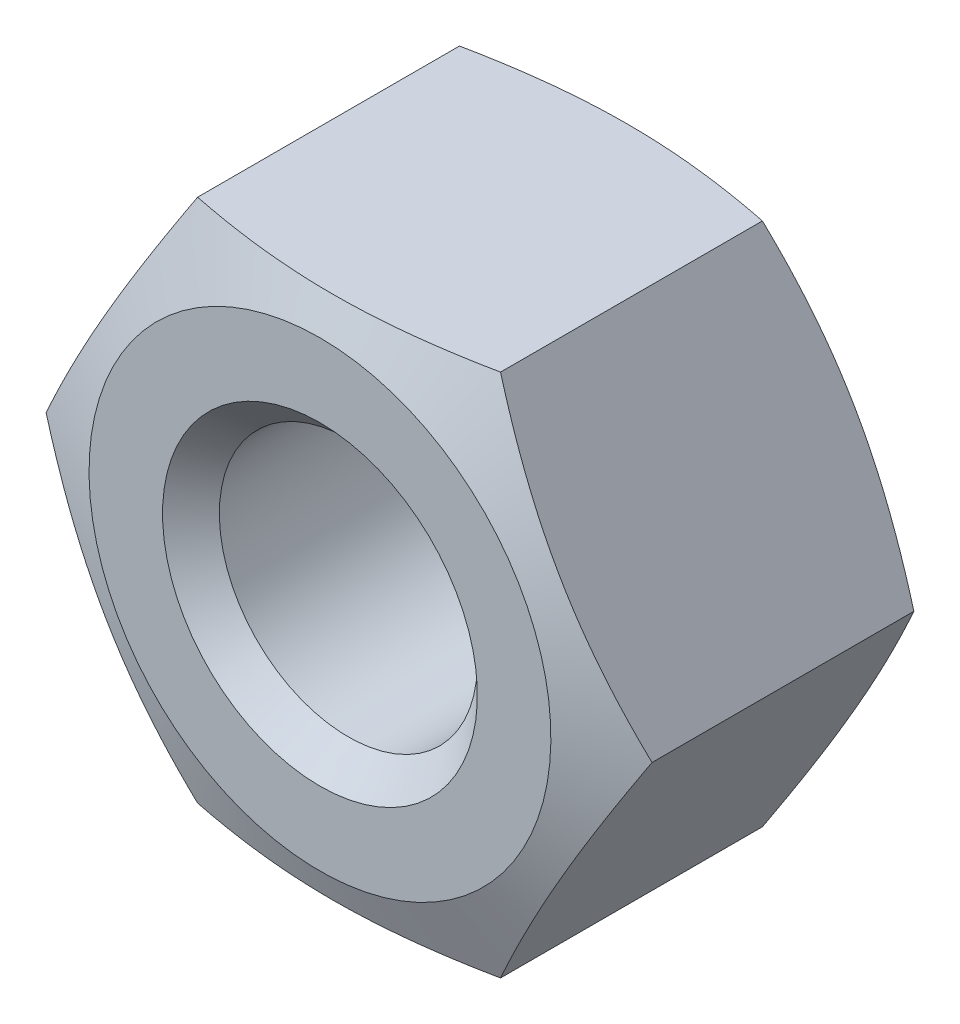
ISO-10303-21;
HEADER;
FILE_DESCRIPTION(('STEP AP214'),'2;1');
FILE_NAME('part.step','',(''),(''),'','','');
FILE_SCHEMA(('AUTOMOTIVE_DESIGN { 1 0 10303 214 1 1 1 1 }'));
ENDSEC;
DATA;
#1=APPLICATION_CONTEXT('core data for automotive mechanical design processes');
#2=APPLICATION_PROTOCOL_DEFINITION('international standard','automotive_design',2000,#1);
#3=PRODUCT_CONTEXT('',#1,'mechanical');
#4=PRODUCT('Part','Part','',(#3));
#5=PRODUCT_RELATED_PRODUCT_CATEGORY('part','',(#4));
#6=PRODUCT_DEFINITION_FORMATION('','',#4);
#7=PRODUCT_DEFINITION_CONTEXT('part definition',#1,'design');
#8=PRODUCT_DEFINITION('design','',#6,#7);
#9=PRODUCT_DEFINITION_SHAPE('','',#8);
#10=(LENGTH_UNIT() NAMED_UNIT(*) SI_UNIT(.MILLI.,.METRE.));
#11=(NAMED_UNIT(*) PLANE_ANGLE_UNIT() SI_UNIT($,.RADIAN.));
#12=(NAMED_UNIT(*) SI_UNIT($,.STERADIAN.) SOLID_ANGLE_UNIT());
#13=UNCERTAINTY_MEASURE_WITH_UNIT(LENGTH_MEASURE(1.E-05),#10,'distance_accuracy_value','');
#14=(GEOMETRIC_REPRESENTATION_CONTEXT(3) GLOBAL_UNCERTAINTY_ASSIGNED_CONTEXT((#13)) GLOBAL_UNIT_ASSIGNED_CONTEXT((#10,
#11,#12)) REPRESENTATION_CONTEXT('',''));
#15=CARTESIAN_POINT('',(0.,0.,0.));
#16=DIRECTION('',(0.,0.,1.));
#17=DIRECTION('',(1.,0.,0.));
#18=AXIS2_PLACEMENT_3D('',#15,#16,#17);
#19=CARTESIAN_POINT('',(5.77349999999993,1.12757025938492E-13,6.09999999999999));
#20=DIRECTION('',(0.,0.,1.));
#21=DIRECTION('',(1.,0.,0.));
#22=AXIS2_PLACEMENT_3D('',#19,#20,#21);
#23=PLANE('',#22);
#24=CARTESIAN_POINT('',(0.,2.2291196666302E-13,6.09999999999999));
#25=DIRECTION('',(0.,0.,-1.));
#26=DIRECTION('',(0.,1.,0.));
#27=AXIS2_PLACEMENT_3D('',#24,#25,#26);
#28=CIRCLE('',#27,3.);
#29=CARTESIAN_POINT('',(0.,3.00000000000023,6.09999999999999));
#30=VERTEX_POINT('',#29);
#31=EDGE_CURVE('E208',#30,#30,#28,.T.);
#32=ORIENTED_EDGE('',*,*,#31,.T.);
#33=EDGE_LOOP('',(#32));
#34=FACE_BOUND('',#33,.T.);
#35=CARTESIAN_POINT('',(0.,2.2291196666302E-13,6.09999999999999));
#36=DIRECTION('',(0.,0.,-1.));
#37=DIRECTION('',(0.,1.,0.));
#38=AXIS2_PLACEMENT_3D('',#35,#36,#37);
#39=CIRCLE('',#38,4.40095183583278);
#40=CARTESIAN_POINT('',(0.,4.40095183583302,6.09999999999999));
#41=VERTEX_POINT('',#40);
#42=EDGE_CURVE('E211',#41,#41,#39,.T.);
#43=ORIENTED_EDGE('',*,*,#42,.F.);
#44=EDGE_LOOP('',(#43));
#45=FACE_BOUND('',#44,.T.);
#46=ADVANCED_FACE('F17',(#34,#45),#23,.T.);
#47=CARTESIAN_POINT('',(0.,2.2291196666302E-13,6.09999999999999));
#48=DIRECTION('',(0.,0.,1.));
#49=DIRECTION('',(0.,-1.,0.));
#50=AXIS2_PLACEMENT_3D('',#47,#48,#49);
#51=CONICAL_SURFACE('',#50,3.,0.785398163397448);
#52=CARTESIAN_POINT('',(0.,0.,5.55875));
#53=DIRECTION('',(0.,0.,-1.));
#54=DIRECTION('',(0.,1.,0.));
#55=AXIS2_PLACEMENT_3D('',#52,#53,#54);
#56=CIRCLE('',#55,2.45875);
#57=CARTESIAN_POINT('',(0.,2.45875000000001,5.55875));
#58=VERTEX_POINT('',#57);
#59=EDGE_CURVE('E98',#58,#58,#56,.T.);
#60=ORIENTED_EDGE('',*,*,#59,.T.);
#61=EDGE_LOOP('',(#60));
#62=FACE_BOUND('',#61,.T.);
#63=ORIENTED_EDGE('',*,*,#31,.F.);
#64=EDGE_LOOP('',(#63));
#65=FACE_BOUND('',#64,.T.);
#66=ADVANCED_FACE('F141',(#62,#65),#51,.F.);
#67=CARTESIAN_POINT('',(0.,0.,0.));
#68=DIRECTION('',(0.,0.,-1.));
#69=DIRECTION('',(0.,1.,0.));
#70=AXIS2_PLACEMENT_3D('',#67,#68,#69);
#71=CYLINDRICAL_SURFACE('',#70,2.45875);
#72=CARTESIAN_POINT('',(0.,0.,0.541250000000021));
#73=DIRECTION('',(0.,0.,-1.));
#74=DIRECTION('',(0.,1.,0.));
#75=AXIS2_PLACEMENT_3D('',#72,#73,#74);
#76=CIRCLE('',#75,2.45875);
#77=CARTESIAN_POINT('',(0.,2.45875000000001,0.541250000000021));
#78=VERTEX_POINT('',#77);
#79=EDGE_CURVE('E95',#78,#78,#76,.T.);
#80=ORIENTED_EDGE('',*,*,#79,.T.);
#81=EDGE_LOOP('',(#80));
#82=FACE_BOUND('',#81,.T.);
#83=ORIENTED_EDGE('',*,*,#59,.F.);
#84=EDGE_LOOP('',(#83));
#85=FACE_BOUND('',#84,.T.);
#86=ADVANCED_FACE('F203',(#82,#85),#71,.F.);
#87=CARTESIAN_POINT('',(0.,0.,0.));
#88=DIRECTION('',(0.,0.,-1.));
#89=DIRECTION('',(0.,1.,0.));
#90=AXIS2_PLACEMENT_3D('',#87,#88,#89);
#91=CONICAL_SURFACE('',#90,3.,0.785398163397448);
#92=ORIENTED_EDGE('',*,*,#79,.F.);
#93=EDGE_LOOP('',(#92));
#94=FACE_BOUND('',#93,.T.);
#95=CARTESIAN_POINT('',(0.,0.,0.));
#96=DIRECTION('',(0.,0.,-1.));
#97=DIRECTION('',(0.,1.,0.));
#98=AXIS2_PLACEMENT_3D('',#95,#96,#97);
#99=CIRCLE('',#98,3.);
#100=CARTESIAN_POINT('',(0.,3.00000000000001,0.));
#101=VERTEX_POINT('',#100);
#102=EDGE_CURVE('E212',#101,#101,#99,.T.);
#103=ORIENTED_EDGE('',*,*,#102,.T.);
#104=EDGE_LOOP('',(#103));
#105=FACE_BOUND('',#104,.T.);
#106=ADVANCED_FACE('F139',(#94,#105),#91,.F.);
#107=CARTESIAN_POINT('',(0.,0.,5.54545454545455));
#108=DIRECTION('',(0.,0.,-1.));
#109=DIRECTION('',(0.,1.,0.));
#110=AXIS2_PLACEMENT_3D('',#107,#108,#109);
#111=CONICAL_SURFACE('',#110,5.7735,1.18682389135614);
#112=ORIENTED_EDGE('',*,*,#42,.T.);
#113=EDGE_LOOP('',(#112));
#114=FACE_BOUND('',#113,.T.);
#115=CARTESIAN_POINT('',(-7.62200767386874,-4.9999976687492,4.19514045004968));
#116=CARTESIAN_POINT('',(-7.39656834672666,-4.99999766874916,4.27127768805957));
#117=CARTESIAN_POINT('',(-7.17082855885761,-4.99999766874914,4.34654172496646));
#118=CARTESIAN_POINT('',(-6.7185926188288,-4.99999766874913,4.49483547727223));
#119=CARTESIAN_POINT('',(-6.4920963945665,-4.99999766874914,4.56786497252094));
#120=CARTESIAN_POINT('',(-6.03768565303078,-4.99999766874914,4.7113604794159));
#121=CARTESIAN_POINT('',(-5.80976902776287,-4.99999766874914,4.78181983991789));
#122=CARTESIAN_POINT('',(-5.35290488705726,-4.99999766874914,4.9193060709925));
#123=CARTESIAN_POINT('',(-5.12395739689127,-4.99999766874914,4.98633302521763));
#124=CARTESIAN_POINT('',(-4.66781400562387,-4.99999766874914,5.11525045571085));
#125=CARTESIAN_POINT('',(-4.44063380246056,-4.99999766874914,5.17719619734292));
#126=CARTESIAN_POINT('',(-3.98489022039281,-4.99999766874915,5.29583960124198));
#127=CARTESIAN_POINT('',(-3.75632680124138,-4.99999766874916,5.35253711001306));
#128=CARTESIAN_POINT('',(-3.29778581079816,-4.99999766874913,5.45932575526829));
#129=CARTESIAN_POINT('',(-3.06780911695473,-4.99999766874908,5.50942062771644));
#130=CARTESIAN_POINT('',(-2.60622171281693,-4.99999766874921,5.60145215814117));
#131=CARTESIAN_POINT('',(-2.3746111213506,-4.99999766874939,5.64338940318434));
#132=CARTESIAN_POINT('',(-1.95734014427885,-4.99999766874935,5.70978116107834));
#133=CARTESIAN_POINT('',(-1.77197103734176,-4.9999976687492,5.73605708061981));
#134=CARTESIAN_POINT('',(-1.4003631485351,-4.99999766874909,5.78145498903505));
#135=CARTESIAN_POINT('',(-1.21412444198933,-4.99999766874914,5.80057758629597));
#136=CARTESIAN_POINT('',(-0.84111100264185,-4.99999766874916,5.83091427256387));
#137=CARTESIAN_POINT('',(-0.654336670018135,-4.99999766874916,5.84213321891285));
#138=CARTESIAN_POINT('',(-0.280469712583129,-4.99999766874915,5.85619153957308));
#139=CARTESIAN_POINT('',(-0.0933770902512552,-4.99999766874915,5.85903097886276));
#140=CARTESIAN_POINT('',(0.281651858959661,-4.99999766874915,5.85619256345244));
#141=CARTESIAN_POINT('',(0.469587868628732,-4.99999766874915,5.85047326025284));
#142=CARTESIAN_POINT('',(0.845017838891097,-4.99999766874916,5.83070414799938));
#143=CARTESIAN_POINT('',(1.03251179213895,-4.99999766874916,5.81665420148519));
#144=CARTESIAN_POINT('',(1.40686944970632,-4.99999766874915,5.78081274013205));
#145=CARTESIAN_POINT('',(1.59373267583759,-4.99999766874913,5.75901629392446));
#146=CARTESIAN_POINT('',(1.96650919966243,-4.99999766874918,5.70850225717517));
#147=CARTESIAN_POINT('',(2.15242250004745,-4.99999766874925,5.67978468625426));
#148=CARTESIAN_POINT('',(2.55438660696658,-4.99999766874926,5.61099947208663));
#149=CARTESIAN_POINT('',(2.77024854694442,-4.99999766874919,5.56983529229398));
#150=CARTESIAN_POINT('',(3.2005675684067,-4.99999766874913,5.48070685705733));
#151=CARTESIAN_POINT('',(3.41502452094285,-4.99999766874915,5.43274198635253));
#152=CARTESIAN_POINT('',(3.84272273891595,-4.99999766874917,5.33124341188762));
#153=CARTESIAN_POINT('',(4.05596332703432,-4.99999766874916,5.27770687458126));
#154=CARTESIAN_POINT('',(4.48125020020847,-4.99999766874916,5.16614085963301));
#155=CARTESIAN_POINT('',(4.6932965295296,-4.99999766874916,5.10811154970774));
#156=CARTESIAN_POINT('',(5.11690900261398,-4.99999766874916,4.98825862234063));
#157=CARTESIAN_POINT('',(5.32847243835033,-4.99999766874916,4.92642547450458));
#158=CARTESIAN_POINT('',(5.75070771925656,-4.99999766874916,4.79978434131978));
#159=CARTESIAN_POINT('',(5.96137954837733,-4.99999766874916,4.73497630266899));
#160=CARTESIAN_POINT('',(6.5921376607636,-4.99999766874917,4.53697630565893));
#161=CARTESIAN_POINT('',(7.01108925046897,-4.99999766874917,4.40017302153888));
#162=CARTESIAN_POINT('',(7.84393068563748,-4.99999766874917,4.12100666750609));
#163=CARTESIAN_POINT('',(8.25783555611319,-4.99999766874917,3.97868798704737));
#164=CARTESIAN_POINT('',(9.08408239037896,-4.99999766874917,3.68949595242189));
#165=CARTESIAN_POINT('',(9.49642423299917,-4.99999766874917,3.54262225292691));
#166=CARTESIAN_POINT('',(10.3171976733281,-4.99999766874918,3.24656607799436));
#167=CARTESIAN_POINT('',(10.7256371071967,-4.99999766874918,3.09740526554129));
#168=CARTESIAN_POINT('',(11.3375987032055,-4.99999766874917,2.87185494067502));
#169=CARTESIAN_POINT('',(11.5414568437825,-4.99999766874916,2.79637478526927));
#170=CARTESIAN_POINT('',(11.9489744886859,-4.99999766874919,2.64488231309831));
#171=CARTESIAN_POINT('',(12.1526339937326,-4.99999766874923,2.56886999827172));
#172=CARTESIAN_POINT('',(12.3562075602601,-4.99999766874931,2.49262826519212));
#173=B_SPLINE_CURVE_WITH_KNOTS('',3,(#115,#116,#117,#118,#119,#120,#121,#122,#123,#124,#125,
#126,#127,#128,#129,#130,#131,#132,#133,#134,#135,#136,#137,#138,#139,#140,#141,#142,#143,#144,
#145,#146,#147,#148,#149,#150,#151,#152,#153,#154,#155,#156,#157,#158,#159,#160,#161,#162,#163,
#164,#165,#166,#167,#168,#169,#170,#171,#172),.UNSPECIFIED.,.F.,.F.,(4,2,2,2,2,2,2,2,2,2,2,2,2,
2,2,2,2,2,2,2,2,2,2,2,2,2,2,2,4),(0.,0.713853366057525,1.42777683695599,2.14343285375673,
2.85907142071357,3.56544487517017,4.27183898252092,4.97783165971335,5.68377351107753,
6.24532011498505,6.80681894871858,7.3679724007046,7.92912150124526,8.49299695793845,
9.05688171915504,9.62112609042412,10.1853688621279,10.8444872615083,11.5036653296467,
12.1631802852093,12.82267063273,13.4838865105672,14.1451142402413,15.4671867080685,
16.7802233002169,18.0933596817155,19.3978209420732,20.0499695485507,20.702115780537),.UNSPECIFIED.);
#174=CARTESIAN_POINT('',(-2.88675000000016,-4.99999766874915,5.54545454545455));
#175=VERTEX_POINT('',#174);
#176=CARTESIAN_POINT('',(2.88674999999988,-4.99999766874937,5.54545454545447));
#177=VERTEX_POINT('',#176);
#178=EDGE_CURVE('E78',#175,#177,#173,.T.);
#179=ORIENTED_EDGE('',*,*,#178,.T.);
#180=CARTESIAN_POINT('',(2.8867498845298,-4.99999786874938,5.54545449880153));
#181=CARTESIAN_POINT('',(2.98760513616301,-4.82531144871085,5.58620500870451));
#182=CARTESIAN_POINT('',(3.08879327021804,-4.65004845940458,5.62388541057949));
#183=CARTESIAN_POINT('',(3.29183863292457,-4.29836357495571,5.69194788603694));
#184=CARTESIAN_POINT('',(3.39369621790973,-4.12194106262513,5.72232568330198));
#185=CARTESIAN_POINT('',(3.59793549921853,-3.76818825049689,5.77456670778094));
#186=CARTESIAN_POINT('',(3.70031703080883,-3.59085823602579,5.79643246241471));
#187=CARTESIAN_POINT('',(3.90546039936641,-3.23553949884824,5.83063610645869));
#188=CARTESIAN_POINT('',(4.00822214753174,-3.05755092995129,5.84297609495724));
#189=CARTESIAN_POINT('',(4.21218124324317,-2.70428341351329,5.85736083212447));
#190=CARTESIAN_POINT('',(4.31337552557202,-2.52900977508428,5.85957683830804));
#191=CARTESIAN_POINT('',(4.51570428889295,-2.1785660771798,5.85406013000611));
#192=CARTESIAN_POINT('',(4.61683876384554,-2.00339602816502,5.84632654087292));
#193=CARTESIAN_POINT('',(4.81874245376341,-1.65368857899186,5.82132638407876));
#194=CARTESIAN_POINT('',(4.9195118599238,-1.47915084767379,5.8040658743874));
#195=CARTESIAN_POINT('',(5.12056954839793,-1.13090871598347,5.76084835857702));
#196=CARTESIAN_POINT('',(5.22085787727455,-0.957204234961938,5.73489221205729));
#197=CARTESIAN_POINT('',(5.35868198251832,-0.718485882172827,5.69386305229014));
#198=CARTESIAN_POINT('',(5.39646887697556,-0.653037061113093,5.68205619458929));
#199=CARTESIAN_POINT('',(5.47195348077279,-0.522293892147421,5.65741433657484));
#200=CARTESIAN_POINT('',(5.50965120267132,-0.456999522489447,5.64457949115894));
#201=CARTESIAN_POINT('',(5.58508963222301,-0.326336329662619,5.61789534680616));
#202=CARTESIAN_POINT('',(5.6228300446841,-0.260968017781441,5.60404272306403));
#203=CARTESIAN_POINT('',(5.69822818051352,-0.130374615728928,5.57542079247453));
#204=CARTESIAN_POINT('',(5.73588589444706,-0.0651495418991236,5.56065138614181));
#205=CARTESIAN_POINT('',(5.77350011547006,2.00000018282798E-07,5.54545449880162));
#206=B_SPLINE_CURVE_WITH_KNOTS('',3,(#180,#181,#182,#183,#184,#185,#186,#187,#188,#189,#190,
#191,#192,#193,#194,#195,#196,#197,#198,#199,#200,#201,#202,#203,#204,#205),.UNSPECIFIED.,.F.,
.F.,(4,2,2,2,2,2,2,2,2,2,2,2,4),(0.,0.61740014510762,1.235160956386,1.85273820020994,
2.47017931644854,3.07713614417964,3.68414633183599,4.29077097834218,4.89733567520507,
5.12680289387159,5.35623560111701,5.58645432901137,5.81669808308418),.UNSPECIFIED.);
#207=CARTESIAN_POINT('',(5.77349999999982,1.12757025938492E-13,5.54545454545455));
#208=VERTEX_POINT('',#207);
#209=EDGE_CURVE('E163',#177,#208,#206,.T.);
#210=ORIENTED_EDGE('',*,*,#209,.T.);
#211=CARTESIAN_POINT('',(5.77350011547,-1.99999848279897E-07,5.54545449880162));
#212=CARTESIAN_POINT('',(5.67264486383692,0.174686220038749,5.58620500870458));
#213=CARTESIAN_POINT('',(5.57145672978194,0.349949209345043,5.62388541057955));
#214=CARTESIAN_POINT('',(5.36841136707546,0.701634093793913,5.69194788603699));
#215=CARTESIAN_POINT('',(5.26655378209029,0.878056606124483,5.72232568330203));
#216=CARTESIAN_POINT('',(5.06231450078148,1.2318094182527,5.77456670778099));
#217=CARTESIAN_POINT('',(4.95993296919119,1.4091394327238,5.79643246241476));
#218=CARTESIAN_POINT('',(4.75478960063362,1.76445816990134,5.83063610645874));
#219=CARTESIAN_POINT('',(4.65202785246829,1.94244673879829,5.84297609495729));
#220=CARTESIAN_POINT('',(4.44806875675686,2.29571425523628,5.85736083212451));
#221=CARTESIAN_POINT('',(4.34687447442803,2.47098789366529,5.85957683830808));
#222=CARTESIAN_POINT('',(4.14454571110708,2.82143159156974,5.85406013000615));
#223=CARTESIAN_POINT('',(4.04341123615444,2.99660164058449,5.84632654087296));
#224=CARTESIAN_POINT('',(3.84150754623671,3.3463090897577,5.82132638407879));
#225=CARTESIAN_POINT('',(3.74073814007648,3.52084682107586,5.80406587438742));
#226=CARTESIAN_POINT('',(3.53968045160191,3.8690889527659,5.76084835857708));
#227=CARTESIAN_POINT('',(3.43939212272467,4.04279343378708,5.7348922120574));
#228=CARTESIAN_POINT('',(3.30156801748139,4.28151178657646,5.69386305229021));
#229=CARTESIAN_POINT('',(3.26378112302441,4.34696060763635,5.68205619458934));
#230=CARTESIAN_POINT('',(3.18829651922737,4.47770377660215,5.65741433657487));
#231=CARTESIAN_POINT('',(3.15059879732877,4.54299814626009,5.64457949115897));
#232=CARTESIAN_POINT('',(3.07516036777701,4.6736613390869,5.61789534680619));
#233=CARTESIAN_POINT('',(3.03741995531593,4.73902965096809,5.60404272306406));
#234=CARTESIAN_POINT('',(2.96202181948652,4.86962305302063,5.57542079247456));
#235=CARTESIAN_POINT('',(2.92436410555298,4.93484812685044,5.56065138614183));
#236=CARTESIAN_POINT('',(2.8867498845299,4.99999786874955,5.54545449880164));
#237=B_SPLINE_CURVE_WITH_KNOTS('',3,(#211,#212,#213,#214,#215,#216,#217,#218,#219,#220,#221,
#222,#223,#224,#225,#226,#227,#228,#229,#230,#231,#232,#233,#234,#235,#236),.UNSPECIFIED.,.F.,
.F.,(4,2,2,2,2,2,2,2,2,2,2,2,4),(0.,0.617400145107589,1.23516095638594,1.85273820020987,
2.47017931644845,3.07713614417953,3.68414633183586,4.29077097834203,4.89733567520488,
5.12680289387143,5.35623560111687,5.58645432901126,5.81669808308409),.UNSPECIFIED.);
#238=CARTESIAN_POINT('',(2.88674999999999,4.99999766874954,5.54545454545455));
#239=VERTEX_POINT('',#238);
#240=EDGE_CURVE('E40',#208,#239,#237,.T.);
#241=ORIENTED_EDGE('',*,*,#240,.T.);
#242=CARTESIAN_POINT('',(-7.62200767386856,4.9999976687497,4.19514045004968));
#243=CARTESIAN_POINT('',(-7.39656834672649,4.99999766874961,4.27127768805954));
#244=CARTESIAN_POINT('',(-7.17082855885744,4.99999766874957,4.34654172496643));
#245=CARTESIAN_POINT('',(-6.71859261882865,4.99999766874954,4.49483547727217));
#246=CARTESIAN_POINT('',(-6.49209639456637,4.99999766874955,4.56786497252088));
#247=CARTESIAN_POINT('',(-6.03768565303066,4.99999766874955,4.71136047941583));
#248=CARTESIAN_POINT('',(-5.80976902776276,4.99999766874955,4.78181983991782));
#249=CARTESIAN_POINT('',(-5.35290488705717,4.99999766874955,4.91930607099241));
#250=CARTESIAN_POINT('',(-5.12395739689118,4.99999766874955,4.98633302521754));
#251=CARTESIAN_POINT('',(-4.66781400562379,4.99999766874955,5.11525045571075));
#252=CARTESIAN_POINT('',(-4.44063380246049,4.99999766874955,5.17719619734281));
#253=CARTESIAN_POINT('',(-3.98489022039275,4.99999766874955,5.29583960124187));
#254=CARTESIAN_POINT('',(-3.75632680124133,4.99999766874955,5.35253711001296));
#255=CARTESIAN_POINT('',(-3.29778581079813,4.99999766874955,5.45932575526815));
#256=CARTESIAN_POINT('',(-3.06780911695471,4.99999766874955,5.50942062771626));
#257=CARTESIAN_POINT('',(-2.60622171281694,4.99999766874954,5.60145215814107));
#258=CARTESIAN_POINT('',(-2.37461112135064,4.99999766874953,5.64338940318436));
#259=CARTESIAN_POINT('',(-1.95734014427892,4.99999766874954,5.70978116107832));
#260=CARTESIAN_POINT('',(-1.77197103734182,4.99999766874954,5.73605708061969));
#261=CARTESIAN_POINT('',(-1.40036314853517,4.99999766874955,5.78145498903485));
#262=CARTESIAN_POINT('',(-1.21412444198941,4.99999766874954,5.8005775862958));
#263=CARTESIAN_POINT('',(-0.841111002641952,4.99999766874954,5.83091427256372));
#264=CARTESIAN_POINT('',(-0.654336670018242,4.99999766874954,5.84213321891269));
#265=CARTESIAN_POINT('',(-0.280469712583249,4.99999766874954,5.85619153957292));
#266=CARTESIAN_POINT('',(-0.0933770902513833,4.99999766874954,5.8590309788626));
#267=CARTESIAN_POINT('',(0.281651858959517,4.99999766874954,5.85619256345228));
#268=CARTESIAN_POINT('',(0.46958786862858,4.99999766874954,5.85047326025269));
#269=CARTESIAN_POINT('',(0.845017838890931,4.99999766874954,5.83070414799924));
#270=CARTESIAN_POINT('',(1.03251179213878,4.99999766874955,5.81665420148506));
#271=CARTESIAN_POINT('',(1.40686944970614,4.99999766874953,5.78081274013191));
#272=CARTESIAN_POINT('',(1.59373267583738,4.9999976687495,5.75901629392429));
#273=CARTESIAN_POINT('',(1.96650919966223,4.99999766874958,5.70850225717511));
#274=CARTESIAN_POINT('',(2.15242250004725,4.99999766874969,5.67978468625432));
#275=CARTESIAN_POINT('',(2.55438660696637,4.99999766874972,5.61099947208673));
#276=CARTESIAN_POINT('',(2.77024854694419,4.99999766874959,5.56983529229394));
#277=CARTESIAN_POINT('',(3.20056756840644,4.99999766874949,5.4807068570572));
#278=CARTESIAN_POINT('',(3.4150245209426,4.99999766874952,5.43274198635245));
#279=CARTESIAN_POINT('',(3.84272273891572,4.99999766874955,5.33124341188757));
#280=CARTESIAN_POINT('',(4.05596332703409,4.99999766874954,5.27770687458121));
#281=CARTESIAN_POINT('',(4.48125020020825,4.99999766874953,5.16614085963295));
#282=CARTESIAN_POINT('',(4.69329652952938,4.99999766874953,5.10811154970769));
#283=CARTESIAN_POINT('',(5.11690900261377,4.99999766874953,4.98825862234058));
#284=CARTESIAN_POINT('',(5.32847243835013,4.99999766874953,4.92642547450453));
#285=CARTESIAN_POINT('',(5.75070771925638,4.99999766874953,4.79978434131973));
#286=CARTESIAN_POINT('',(5.96137954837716,4.99999766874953,4.73497630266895));
#287=CARTESIAN_POINT('',(6.59213766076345,4.99999766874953,4.5369763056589));
#288=CARTESIAN_POINT('',(7.01108925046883,4.99999766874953,4.40017302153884));
#289=CARTESIAN_POINT('',(7.84393068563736,4.99999766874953,4.12100666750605));
#290=CARTESIAN_POINT('',(8.25783555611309,4.99999766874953,3.97868798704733));
#291=CARTESIAN_POINT('',(9.08408239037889,4.99999766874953,3.68949595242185));
#292=CARTESIAN_POINT('',(9.49642423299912,4.99999766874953,3.54262225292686));
#293=CARTESIAN_POINT('',(10.3171976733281,4.99999766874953,3.24656607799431));
#294=CARTESIAN_POINT('',(10.7256371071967,4.99999766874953,3.09740526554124));
#295=CARTESIAN_POINT('',(11.3375987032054,4.99999766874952,2.87185494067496));
#296=CARTESIAN_POINT('',(11.5414568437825,4.99999766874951,2.79637478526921));
#297=CARTESIAN_POINT('',(11.9489744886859,4.99999766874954,2.64488231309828));
#298=CARTESIAN_POINT('',(12.1526339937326,4.99999766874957,2.5688699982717));
#299=CARTESIAN_POINT('',(12.3562075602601,4.99999766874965,2.49262826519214));
#300=B_SPLINE_CURVE_WITH_KNOTS('',3,(#242,#243,#244,#245,#246,#247,#248,#249,#250,#251,#252,
#253,#254,#255,#256,#257,#258,#259,#260,#261,#262,#263,#264,#265,#266,#267,#268,#269,#270,#271,
#272,#273,#274,#275,#276,#277,#278,#279,#280,#281,#282,#283,#284,#285,#286,#287,#288,#289,#290,
#291,#292,#293,#294,#295,#296,#297,#298,#299),.UNSPECIFIED.,.F.,.F.,(4,2,2,2,2,2,2,2,2,2,2,2,2,
2,2,2,2,2,2,2,2,2,2,2,2,2,2,2,4),(0.,0.713853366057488,1.42777683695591,2.14343285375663,
2.85907142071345,3.56544487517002,4.27183898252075,4.97783165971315,5.68377351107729,
6.24532011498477,6.80681894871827,7.36797240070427,7.92912150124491,8.49299695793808,
9.05688171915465,9.6211260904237,10.1853688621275,10.8444872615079,11.5036653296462,
12.1631802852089,12.8226706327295,13.4838865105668,14.1451142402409,15.4671867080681,
16.7802233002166,18.0933596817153,19.397820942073,20.0499695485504,20.7021157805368),.UNSPECIFIED.);
#301=CARTESIAN_POINT('',(-2.88675000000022,4.99999766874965,5.54545454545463));
#302=VERTEX_POINT('',#301);
#303=EDGE_CURVE('E154',#239,#302,#300,.F.);
#304=ORIENTED_EDGE('',*,*,#303,.T.);
#305=CARTESIAN_POINT('',(-2.88674988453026,4.99999786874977,5.5454544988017));
#306=CARTESIAN_POINT('',(-2.98760513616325,4.8253114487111,5.58620500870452));
#307=CARTESIAN_POINT('',(-3.08879327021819,4.65004845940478,5.62388541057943));
#308=CARTESIAN_POINT('',(-3.29183863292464,4.29836357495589,5.69194788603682));
#309=CARTESIAN_POINT('',(-3.39369621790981,4.12194106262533,5.72232568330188));
#310=CARTESIAN_POINT('',(-3.59793549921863,3.76818825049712,5.77456670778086));
#311=CARTESIAN_POINT('',(-3.70031703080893,3.590858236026,5.79643246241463));
#312=CARTESIAN_POINT('',(-3.90546039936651,3.23553949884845,5.8306361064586));
#313=CARTESIAN_POINT('',(-4.00822214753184,3.05755092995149,5.84297609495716));
#314=CARTESIAN_POINT('',(-4.21218124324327,2.7042834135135,5.85736083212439));
#315=CARTESIAN_POINT('',(-4.31337552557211,2.52900977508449,5.85957683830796));
#316=CARTESIAN_POINT('',(-4.51570428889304,2.17856607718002,5.85406013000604));
#317=CARTESIAN_POINT('',(-4.61683876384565,2.00339602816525,5.84632654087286));
#318=CARTESIAN_POINT('',(-4.81874245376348,1.65368857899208,5.82132638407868));
#319=CARTESIAN_POINT('',(-4.91951185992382,1.479150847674,5.80406587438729));
#320=CARTESIAN_POINT('',(-5.12056954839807,1.13090871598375,5.76084835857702));
#321=CARTESIAN_POINT('',(-5.22085787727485,0.957204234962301,5.73489221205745));
#322=CARTESIAN_POINT('',(-5.35868198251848,0.718485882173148,5.69386305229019));
#323=CARTESIAN_POINT('',(-5.39646887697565,0.653037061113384,5.68205619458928));
#324=CARTESIAN_POINT('',(-5.47195348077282,0.522293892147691,5.65741433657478));
#325=CARTESIAN_POINT('',(-5.50965120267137,0.456999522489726,5.6445794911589));
#326=CARTESIAN_POINT('',(-5.58508963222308,0.326336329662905,5.61789534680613));
#327=CARTESIAN_POINT('',(-5.62283004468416,0.260968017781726,5.60404272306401));
#328=CARTESIAN_POINT('',(-5.69822818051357,0.130374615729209,5.57542079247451));
#329=CARTESIAN_POINT('',(-5.7358858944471,0.0651495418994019,5.56065138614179));
#330=CARTESIAN_POINT('',(-5.77350011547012,-1.99999738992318E-07,5.54545449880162));
#331=B_SPLINE_CURVE_WITH_KNOTS('',3,(#305,#306,#307,#308,#309,#310,#311,#312,#313,#314,#315,
#316,#317,#318,#319,#320,#321,#322,#323,#324,#325,#326,#327,#328,#329,#330),.UNSPECIFIED.,.F.,
.F.,(4,2,2,2,2,2,2,2,2,2,2,2,4),(0.,0.617400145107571,1.23516095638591,1.85273820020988,
2.47017931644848,3.07713614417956,3.6841463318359,4.29077097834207,4.89733567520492,
5.12680289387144,5.35623560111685,5.58645432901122,5.81669808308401),.UNSPECIFIED.);
#332=CARTESIAN_POINT('',(-5.77350000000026,1.10154940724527E-13,5.54545454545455));
#333=VERTEX_POINT('',#332);
#334=EDGE_CURVE('E149',#302,#333,#331,.T.);
#335=ORIENTED_EDGE('',*,*,#334,.T.);
#336=CARTESIAN_POINT('',(-5.77350011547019,2.00000071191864E-07,5.54545449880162));
#337=CARTESIAN_POINT('',(-5.67264486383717,-0.174686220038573,5.58620500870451));
#338=CARTESIAN_POINT('',(-5.57145672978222,-0.349949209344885,5.62388541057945));
#339=CARTESIAN_POINT('',(-5.36841136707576,-0.701634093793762,5.69194788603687));
#340=CARTESIAN_POINT('',(-5.2665537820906,-0.878056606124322,5.72232568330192));
#341=CARTESIAN_POINT('',(-5.06231450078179,-1.23180941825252,5.77456670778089));
#342=CARTESIAN_POINT('',(-4.9599329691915,-1.40913943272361,5.79643246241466));
#343=CARTESIAN_POINT('',(-4.75478960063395,-1.76445816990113,5.83063610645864));
#344=CARTESIAN_POINT('',(-4.65202785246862,-1.94244673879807,5.8429760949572));
#345=CARTESIAN_POINT('',(-4.44806875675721,-2.29571425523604,5.85736083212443));
#346=CARTESIAN_POINT('',(-4.34687447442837,-2.47098789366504,5.85957683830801));
#347=CARTESIAN_POINT('',(-4.14454571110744,-2.82143159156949,5.85406013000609));
#348=CARTESIAN_POINT('',(-4.04341123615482,-2.99660164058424,5.8463265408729));
#349=CARTESIAN_POINT('',(-3.84150754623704,-3.34630908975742,5.82132638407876));
#350=CARTESIAN_POINT('',(-3.74073814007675,-3.52084682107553,5.80406587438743));
#351=CARTESIAN_POINT('',(-3.53968045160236,-3.86908895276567,5.76084835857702));
#352=CARTESIAN_POINT('',(-3.43939212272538,-4.04279343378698,5.73489221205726));
#353=CARTESIAN_POINT('',(-3.3015680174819,-4.28151178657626,5.69386305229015));
#354=CARTESIAN_POINT('',(-3.26378112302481,-4.3469606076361,5.68205619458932));
#355=CARTESIAN_POINT('',(-3.18829651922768,-4.47770377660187,5.65741433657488));
#356=CARTESIAN_POINT('',(-3.15059879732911,-4.54299814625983,5.64457949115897));
#357=CARTESIAN_POINT('',(-3.07516036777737,-4.67366133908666,5.61789534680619));
#358=CARTESIAN_POINT('',(-3.03741995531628,-4.73902965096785,5.60404272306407));
#359=CARTESIAN_POINT('',(-2.96202181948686,-4.86962305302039,5.57542079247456));
#360=CARTESIAN_POINT('',(-2.92436410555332,-4.93484812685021,5.56065138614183));
#361=CARTESIAN_POINT('',(-2.88674988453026,-4.99999786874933,5.54545449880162));
#362=B_SPLINE_CURVE_WITH_KNOTS('',3,(#336,#337,#338,#339,#340,#341,#342,#343,#344,#345,#346,
#347,#348,#349,#350,#351,#352,#353,#354,#355,#356,#357,#358,#359,#360,#361),.UNSPECIFIED.,.F.,
.F.,(4,2,2,2,2,2,2,2,2,2,2,2,4),(0.,0.617400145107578,1.23516095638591,1.85273820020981,
2.47017931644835,3.07713614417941,3.68414633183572,4.29077097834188,4.89733567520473,
5.12680289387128,5.35623560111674,5.58645432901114,5.81669808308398),.UNSPECIFIED.);
#363=EDGE_CURVE('E126',#333,#175,#362,.T.);
#364=ORIENTED_EDGE('',*,*,#363,.T.);
#365=EDGE_LOOP('',(#179,#210,#241,#304,#335,#364));
#366=FACE_BOUND('',#365,.T.);
#367=ADVANCED_FACE('F135',(#114,#366),#111,.T.);
#368=CARTESIAN_POINT('',(2.88675000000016,-4.99999766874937,6.09999999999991));
#369=DIRECTION('',(-0.86602540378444,0.5,0.));
#370=DIRECTION('',(-0.500000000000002,-0.866025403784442,0.));
#371=AXIS2_PLACEMENT_3D('',#368,#369,#370);
#372=PLANE('',#371);
#373=ORIENTED_EDGE('',*,*,#209,.F.);
#374=DIRECTION('',(0.,0.,-1.));
#375=VECTOR('',#374,1.);
#376=CARTESIAN_POINT('',(2.88675000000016,-4.99999766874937,6.09999999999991));
#377=LINE('',#376,#375);
#378=CARTESIAN_POINT('',(2.88674999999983,-4.99999766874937,0.554545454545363));
#379=VERTEX_POINT('',#378);
#380=EDGE_CURVE('E82',#177,#379,#377,.T.);
#381=ORIENTED_EDGE('',*,*,#380,.T.);
#382=CARTESIAN_POINT('',(5.7735001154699,2.00000130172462E-07,0.554545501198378));
#383=CARTESIAN_POINT('',(5.672644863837,-0.174686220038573,0.513794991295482));
#384=CARTESIAN_POINT('',(5.5714567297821,-0.349949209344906,0.476114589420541));
#385=CARTESIAN_POINT('',(5.36841136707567,-0.701634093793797,0.408052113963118));
#386=CARTESIAN_POINT('',(5.26655378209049,-0.87805660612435,0.377674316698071));
#387=CARTESIAN_POINT('',(5.06231450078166,-1.23180941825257,0.325433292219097));
#388=CARTESIAN_POINT('',(4.95993296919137,-1.40913943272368,0.303567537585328));
#389=CARTESIAN_POINT('',(4.75478960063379,-1.76445816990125,0.269363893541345));
#390=CARTESIAN_POINT('',(4.65202785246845,-1.94244673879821,0.257023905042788));
#391=CARTESIAN_POINT('',(4.44806875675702,-2.29571425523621,0.242639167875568));
#392=CARTESIAN_POINT('',(4.3468744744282,-2.47098789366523,0.240423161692));
#393=CARTESIAN_POINT('',(4.14454571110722,-2.82143159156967,0.245939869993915));
#394=CARTESIAN_POINT('',(4.04341123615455,-2.99660164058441,0.253673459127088));
#395=CARTESIAN_POINT('',(3.84150754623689,-3.34630908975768,0.278673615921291));
#396=CARTESIAN_POINT('',(3.74073814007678,-3.52084682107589,0.295934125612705));
#397=CARTESIAN_POINT('',(3.5396804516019,-3.86908895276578,0.339151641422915));
#398=CARTESIAN_POINT('',(3.43939212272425,-4.04279343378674,0.365107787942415));
#399=CARTESIAN_POINT('',(3.30156801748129,-4.28151178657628,0.406136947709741));
#400=CARTESIAN_POINT('',(3.26378112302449,-4.34696060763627,0.417943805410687));
#401=CARTESIAN_POINT('',(3.18829651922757,-4.47770377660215,0.442585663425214));
#402=CARTESIAN_POINT('',(3.15059879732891,-4.54299814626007,0.455420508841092));
#403=CARTESIAN_POINT('',(3.07516036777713,-4.67366133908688,0.482104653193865));
#404=CARTESIAN_POINT('',(3.03741995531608,-4.7390296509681,0.495957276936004));
#405=CARTESIAN_POINT('',(2.96202181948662,-4.86962305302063,0.524579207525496));
#406=CARTESIAN_POINT('',(2.92436410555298,-4.9348481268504,0.53934861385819));
#407=CARTESIAN_POINT('',(2.88674988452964,-4.99999786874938,0.554545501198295));
#408=B_SPLINE_CURVE_WITH_KNOTS('',3,(#382,#383,#384,#385,#386,#387,#388,#389,#390,#391,#392,
#393,#394,#395,#396,#397,#398,#399,#400,#401,#402,#403,#404,#405,#406,#407),.UNSPECIFIED.,.F.,
.F.,(4,2,2,2,2,2,2,2,2,2,2,2,4),(0.,0.617400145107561,1.23516095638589,1.85273820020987,
2.47017931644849,3.07713614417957,3.68414633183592,4.29077097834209,4.89733567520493,
5.1268028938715,5.35623560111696,5.58645432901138,5.81669808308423),.UNSPECIFIED.);
#409=CARTESIAN_POINT('',(5.77349999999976,0.,0.554545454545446));
#410=VERTEX_POINT('',#409);
#411=EDGE_CURVE('E33',#410,#379,#408,.T.);
#412=ORIENTED_EDGE('',*,*,#411,.F.);
#413=DIRECTION('',(0.,0.,-1.));
#414=VECTOR('',#413,1.);
#415=CARTESIAN_POINT('',(5.77349999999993,1.12757025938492E-13,6.09999999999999));
#416=LINE('',#415,#414);
#417=EDGE_CURVE('E26',#208,#410,#416,.T.);
#418=ORIENTED_EDGE('',*,*,#417,.F.);
#419=EDGE_LOOP('',(#373,#381,#412,#418));
#420=FACE_BOUND('',#419,.T.);
#421=ADVANCED_FACE('F19',(#420),#372,.F.);
#422=CARTESIAN_POINT('',(5.77349999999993,1.12757025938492E-13,6.09999999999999));
#423=DIRECTION('',(-0.86602540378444,-0.500000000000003,0.));
#424=DIRECTION('',(0.5,-0.866025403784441,0.));
#425=AXIS2_PLACEMENT_3D('',#422,#423,#424);
#426=PLANE('',#425);
#427=ORIENTED_EDGE('',*,*,#240,.F.);
#428=ORIENTED_EDGE('',*,*,#417,.T.);
#429=CARTESIAN_POINT('',(2.88674988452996,4.99999786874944,0.554545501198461));
#430=CARTESIAN_POINT('',(2.987605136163,4.82531144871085,0.513794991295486));
#431=CARTESIAN_POINT('',(3.08879327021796,4.65004845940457,0.476114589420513));
#432=CARTESIAN_POINT('',(3.29183863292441,4.29836357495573,0.408052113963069));
#433=CARTESIAN_POINT('',(3.39369621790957,4.12194106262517,0.377674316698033));
#434=CARTESIAN_POINT('',(3.59793549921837,3.76818825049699,0.325433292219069));
#435=CARTESIAN_POINT('',(3.70031703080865,3.5908582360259,0.303567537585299));
#436=CARTESIAN_POINT('',(3.90546039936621,3.23553949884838,0.269363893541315));
#437=CARTESIAN_POINT('',(4.00822214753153,3.05755092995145,0.257023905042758));
#438=CARTESIAN_POINT('',(4.21218124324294,2.70428341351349,0.242639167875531));
#439=CARTESIAN_POINT('',(4.31337552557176,2.5290097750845,0.240423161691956));
#440=CARTESIAN_POINT('',(4.51570428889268,2.17856607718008,0.245939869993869));
#441=CARTESIAN_POINT('',(4.61683876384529,2.00339602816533,0.253673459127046));
#442=CARTESIAN_POINT('',(4.81874245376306,1.65368857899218,0.27867361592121));
#443=CARTESIAN_POINT('',(4.91951185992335,1.47915084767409,0.295934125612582));
#444=CARTESIAN_POINT('',(5.1205695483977,1.13090871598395,0.339151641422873));
#445=CARTESIAN_POINT('',(5.22085787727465,0.957204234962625,0.365107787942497));
#446=CARTESIAN_POINT('',(5.35868198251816,0.718485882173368,0.406136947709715));
#447=CARTESIAN_POINT('',(5.39646887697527,0.653037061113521,0.417943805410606));
#448=CARTESIAN_POINT('',(5.47195348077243,0.522293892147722,0.442585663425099));
#449=CARTESIAN_POINT('',(5.50965120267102,0.456999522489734,0.455420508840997));
#450=CARTESIAN_POINT('',(5.58508963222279,0.326336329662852,0.482104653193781));
#451=CARTESIAN_POINT('',(5.62283004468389,0.260968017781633,0.49595727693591));
#452=CARTESIAN_POINT('',(5.69822818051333,0.130374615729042,0.524579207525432));
#453=CARTESIAN_POINT('',(5.73588589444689,0.0651495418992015,0.539348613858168));
#454=CARTESIAN_POINT('',(5.77350011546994,-1.99999959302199E-07,0.554545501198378));
#455=B_SPLINE_CURVE_WITH_KNOTS('',3,(#429,#430,#431,#432,#433,#434,#435,#436,#437,#438,#439,
#440,#441,#442,#443,#444,#445,#446,#447,#448,#449,#450,#451,#452,#453,#454),.UNSPECIFIED.,.F.,
.F.,(4,2,2,2,2,2,2,2,2,2,2,2,4),(0.,0.61740014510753,1.23516095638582,1.85273820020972,
2.47017931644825,3.07713614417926,3.68414633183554,4.29077097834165,4.89733567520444,
5.12680289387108,5.35623560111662,5.58645432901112,5.81669808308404),.UNSPECIFIED.);
#456=CARTESIAN_POINT('',(2.88674999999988,4.99999766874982,0.55454545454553));
#457=VERTEX_POINT('',#456);
#458=EDGE_CURVE('E174',#457,#410,#455,.T.);
#459=ORIENTED_EDGE('',*,*,#458,.F.);
#460=DIRECTION('',(0.,0.,-1.));
#461=VECTOR('',#460,1.);
#462=CARTESIAN_POINT('',(2.88674999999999,4.99999766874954,6.10000000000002));
#463=LINE('',#462,#461);
#464=EDGE_CURVE('E301',#239,#457,#463,.T.);
#465=ORIENTED_EDGE('',*,*,#464,.F.);
#466=EDGE_LOOP('',(#427,#428,#459,#465));
#467=FACE_BOUND('',#466,.T.);
#468=ADVANCED_FACE('F168',(#467),#426,.F.);
#469=CARTESIAN_POINT('',(2.88674999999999,4.99999766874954,6.10000000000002));
#470=DIRECTION('',(0.,-1.,0.));
#471=DIRECTION('',(1.,0.,0.));
#472=AXIS2_PLACEMENT_3D('',#469,#470,#471);
#473=PLANE('',#472);
#474=ORIENTED_EDGE('',*,*,#303,.F.);
#475=ORIENTED_EDGE('',*,*,#464,.T.);
#476=CARTESIAN_POINT('',(-7.62200767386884,4.99999766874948,1.90485954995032));
#477=CARTESIAN_POINT('',(-7.39656834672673,4.99999766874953,1.82872231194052));
#478=CARTESIAN_POINT('',(-7.17082855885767,4.99999766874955,1.75345827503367));
#479=CARTESIAN_POINT('',(-6.71859261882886,4.99999766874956,1.60516452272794));
#480=CARTESIAN_POINT('',(-6.49209639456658,4.99999766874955,1.53213502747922));
#481=CARTESIAN_POINT('',(-6.03768565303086,4.99999766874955,1.38863952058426));
#482=CARTESIAN_POINT('',(-5.80976902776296,4.99999766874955,1.31818016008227));
#483=CARTESIAN_POINT('',(-5.35290488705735,4.99999766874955,1.18069392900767));
#484=CARTESIAN_POINT('',(-5.12395739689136,4.99999766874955,1.11366697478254));
#485=CARTESIAN_POINT('',(-4.66781400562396,4.99999766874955,0.984749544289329));
#486=CARTESIAN_POINT('',(-4.44063380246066,4.99999766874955,0.922803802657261));
#487=CARTESIAN_POINT('',(-3.98489022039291,4.99999766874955,0.8041603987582));
#488=CARTESIAN_POINT('',(-3.75632680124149,4.99999766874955,0.747462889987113));
#489=CARTESIAN_POINT('',(-3.29778581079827,4.99999766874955,0.640674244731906));
#490=CARTESIAN_POINT('',(-3.06780911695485,4.99999766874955,0.590579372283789));
#491=CARTESIAN_POINT('',(-2.60622171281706,4.99999766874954,0.49854784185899));
#492=CARTESIAN_POINT('',(-2.37461112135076,4.99999766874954,0.456610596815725));
#493=CARTESIAN_POINT('',(-1.95734014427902,4.99999766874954,0.390218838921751));
#494=CARTESIAN_POINT('',(-1.77197103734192,4.99999766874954,0.363942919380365));
#495=CARTESIAN_POINT('',(-1.40036314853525,4.99999766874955,0.318545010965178));
#496=CARTESIAN_POINT('',(-1.21412444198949,4.99999766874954,0.299422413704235));
#497=CARTESIAN_POINT('',(-0.841111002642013,4.99999766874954,0.269085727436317));
#498=CARTESIAN_POINT('',(-0.654336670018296,4.99999766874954,0.25786678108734));
#499=CARTESIAN_POINT('',(-0.28046971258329,4.99999766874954,0.243808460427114));
#500=CARTESIAN_POINT('',(-0.0933770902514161,4.99999766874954,0.240969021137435));
#501=CARTESIAN_POINT('',(0.2816518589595,4.99999766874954,0.243807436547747));
#502=CARTESIAN_POINT('',(0.46958786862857,4.99999766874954,0.249526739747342));
#503=CARTESIAN_POINT('',(0.845017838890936,4.99999766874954,0.26929585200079));
#504=CARTESIAN_POINT('',(1.0325117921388,4.99999766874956,0.283345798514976));
#505=CARTESIAN_POINT('',(1.40686944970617,4.99999766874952,0.319187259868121));
#506=CARTESIAN_POINT('',(1.59373267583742,4.99999766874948,0.340983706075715));
#507=CARTESIAN_POINT('',(1.96650919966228,4.99999766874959,0.391497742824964));
#508=CARTESIAN_POINT('',(2.1524225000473,4.99999766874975,0.420215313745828));
#509=CARTESIAN_POINT('',(2.55438660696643,4.99999766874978,0.489000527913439));
#510=CARTESIAN_POINT('',(2.77024854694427,4.9999976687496,0.530164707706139));
#511=CARTESIAN_POINT('',(3.20056756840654,4.99999766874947,0.61929314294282));
#512=CARTESIAN_POINT('',(3.4150245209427,4.99999766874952,0.667258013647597));
#513=CARTESIAN_POINT('',(3.8427227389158,4.99999766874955,0.768756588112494));
#514=CARTESIAN_POINT('',(4.05596332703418,4.99999766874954,0.822293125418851));
#515=CARTESIAN_POINT('',(4.48125020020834,4.99999766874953,0.9338591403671));
#516=CARTESIAN_POINT('',(4.69329652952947,4.99999766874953,0.991888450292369));
#517=CARTESIAN_POINT('',(5.11690900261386,4.99999766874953,1.11174137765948));
#518=CARTESIAN_POINT('',(5.32847243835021,4.99999766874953,1.17357452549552));
#519=CARTESIAN_POINT('',(5.75070771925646,4.99999766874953,1.30021565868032));
#520=CARTESIAN_POINT('',(5.96137954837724,4.99999766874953,1.36502369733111));
#521=CARTESIAN_POINT('',(6.59213766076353,4.99999766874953,1.56302369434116));
#522=CARTESIAN_POINT('',(7.0110892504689,4.99999766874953,1.69982697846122));
#523=CARTESIAN_POINT('',(7.84393068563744,4.99999766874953,1.97899333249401));
#524=CARTESIAN_POINT('',(8.25783555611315,4.99999766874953,2.12131201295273));
#525=CARTESIAN_POINT('',(9.08408239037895,4.99999766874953,2.41050404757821));
#526=CARTESIAN_POINT('',(9.49642423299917,4.99999766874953,2.55737774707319));
#527=CARTESIAN_POINT('',(10.3171976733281,4.99999766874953,2.85343392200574));
#528=CARTESIAN_POINT('',(10.7256371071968,4.99999766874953,3.00259473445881));
#529=CARTESIAN_POINT('',(11.3375987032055,4.99999766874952,3.22814505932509));
#530=CARTESIAN_POINT('',(11.5414568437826,4.99999766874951,3.30362521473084));
#531=CARTESIAN_POINT('',(11.9489744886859,4.99999766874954,3.45511768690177));
#532=CARTESIAN_POINT('',(12.1526339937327,4.99999766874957,3.53113000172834));
#533=CARTESIAN_POINT('',(12.3562075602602,4.99999766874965,3.60737173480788));
#534=B_SPLINE_CURVE_WITH_KNOTS('',3,(#476,#477,#478,#479,#480,#481,#482,#483,#484,#485,#486,
#487,#488,#489,#490,#491,#492,#493,#494,#495,#496,#497,#498,#499,#500,#501,#502,#503,#504,#505,
#506,#507,#508,#509,#510,#511,#512,#513,#514,#515,#516,#517,#518,#519,#520,#521,#522,#523,#524,
#525,#526,#527,#528,#529,#530,#531,#532,#533),.UNSPECIFIED.,.F.,.F.,(4,2,2,2,2,2,2,2,2,2,2,2,2,
2,2,2,2,2,2,2,2,2,2,2,2,2,2,2,4),(0.,0.713853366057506,1.42777683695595,2.14343285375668,
2.85907142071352,3.5654448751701,4.27183898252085,4.97783165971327,5.68377351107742,
6.24532011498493,6.80681894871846,7.36797240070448,7.92912150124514,8.49299695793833,
9.05688171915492,9.621126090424,10.1853688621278,10.8444872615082,11.5036653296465,
12.1631802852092,12.8226706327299,13.4838865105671,14.1451142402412,15.4671867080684,
16.7802233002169,18.0933596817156,19.3978209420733,20.0499695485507,20.7021157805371),.UNSPECIFIED.);
#535=CARTESIAN_POINT('',(-2.88675000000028,4.99999766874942,0.55454545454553));
#536=VERTEX_POINT('',#535);
#537=EDGE_CURVE('E179',#536,#457,#534,.T.);
#538=ORIENTED_EDGE('',*,*,#537,.F.);
#539=DIRECTION('',(0.,0.,-1.));
#540=VECTOR('',#539,1.);
#541=CARTESIAN_POINT('',(-2.88675000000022,4.99999766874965,6.10000000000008));
#542=LINE('',#541,#540);
#543=EDGE_CURVE('E303',#302,#536,#542,.T.);
#544=ORIENTED_EDGE('',*,*,#543,.F.);
#545=EDGE_LOOP('',(#474,#475,#538,#544));
#546=FACE_BOUND('',#545,.T.);
#547=ADVANCED_FACE('F171',(#546),#473,.F.);
#548=CARTESIAN_POINT('',(-2.88675000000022,4.99999766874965,6.10000000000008));
#549=DIRECTION('',(0.86602540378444,-0.5,0.));
#550=DIRECTION('',(0.500000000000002,0.866025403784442,0.));
#551=AXIS2_PLACEMENT_3D('',#548,#549,#550);
#552=PLANE('',#551);
#553=ORIENTED_EDGE('',*,*,#334,.F.);
#554=ORIENTED_EDGE('',*,*,#543,.T.);
#555=CARTESIAN_POINT('',(-5.77350011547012,-1.99999794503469E-07,0.554545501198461));
#556=CARTESIAN_POINT('',(-5.67264486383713,0.174686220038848,0.513794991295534));
#557=CARTESIAN_POINT('',(-5.57145672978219,0.349949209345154,0.476114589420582));
#558=CARTESIAN_POINT('',(-5.36841136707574,0.701634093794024,0.408052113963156));
#559=CARTESIAN_POINT('',(-5.26655378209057,0.878056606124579,0.377674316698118));
#560=CARTESIAN_POINT('',(-5.06231450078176,1.23180941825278,0.325433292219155));
#561=CARTESIAN_POINT('',(-4.95993296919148,1.40913943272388,0.30356753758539));
#562=CARTESIAN_POINT('',(-4.75478960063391,1.76445816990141,0.269363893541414));
#563=CARTESIAN_POINT('',(-4.65202785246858,1.94244673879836,0.25702390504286));
#564=CARTESIAN_POINT('',(-4.44806875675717,2.29571425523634,0.242639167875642));
#565=CARTESIAN_POINT('',(-4.34687447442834,2.47098789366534,0.240423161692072));
#566=CARTESIAN_POINT('',(-4.14454571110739,2.82143159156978,0.245939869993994));
#567=CARTESIAN_POINT('',(-4.04341123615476,2.99660164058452,0.253673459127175));
#568=CARTESIAN_POINT('',(-3.84150754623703,3.34630908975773,0.27867361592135));
#569=CARTESIAN_POINT('',(-3.74073814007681,3.52084682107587,0.295934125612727));
#570=CARTESIAN_POINT('',(-3.53968045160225,3.86908895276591,0.339151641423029));
#571=CARTESIAN_POINT('',(-3.43939212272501,4.04279343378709,0.365107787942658));
#572=CARTESIAN_POINT('',(-3.30156801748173,4.28151178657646,0.40613694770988));
#573=CARTESIAN_POINT('',(-3.26378112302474,4.34696060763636,0.417943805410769));
#574=CARTESIAN_POINT('',(-3.18829651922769,4.47770377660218,0.442585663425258));
#575=CARTESIAN_POINT('',(-3.15059879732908,4.54299814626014,0.455420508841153));
#576=CARTESIAN_POINT('',(-3.0751603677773,4.67366133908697,0.482104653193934));
#577=CARTESIAN_POINT('',(-3.03741995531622,4.73902965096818,0.495957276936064));
#578=CARTESIAN_POINT('',(-2.96202181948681,4.86962305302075,0.52457920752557));
#579=CARTESIAN_POINT('',(-2.92436410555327,4.93484812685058,0.539348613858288));
#580=CARTESIAN_POINT('',(-2.88674988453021,4.99999786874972,0.554545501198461));
#581=B_SPLINE_CURVE_WITH_KNOTS('',3,(#555,#556,#557,#558,#559,#560,#561,#562,#563,#564,#565,
#566,#567,#568,#569,#570,#571,#572,#573,#574,#575,#576,#577,#578,#579,#580),.UNSPECIFIED.,.F.,
.F.,(4,2,2,2,2,2,2,2,2,2,2,2,4),(0.,0.617400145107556,1.23516095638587,1.8527382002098,
2.47017931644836,3.07713614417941,3.68414633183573,4.29077097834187,4.8973356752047,
5.12680289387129,5.35623560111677,5.58645432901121,5.81669808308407),.UNSPECIFIED.);
#582=CARTESIAN_POINT('',(-5.77350000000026,1.10154940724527E-13,0.55454545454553));
#583=VERTEX_POINT('',#582);
#584=EDGE_CURVE('E91',#583,#536,#581,.T.);
#585=ORIENTED_EDGE('',*,*,#584,.F.);
#586=DIRECTION('',(0.,0.,-1.));
#587=VECTOR('',#586,1.);
#588=CARTESIAN_POINT('',(-5.77350000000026,1.10154940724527E-13,6.09999999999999));
#589=LINE('',#588,#587);
#590=EDGE_CURVE('E81',#333,#583,#589,.T.);
#591=ORIENTED_EDGE('',*,*,#590,.F.);
#592=EDGE_LOOP('',(#553,#554,#585,#591));
#593=FACE_BOUND('',#592,.T.);
#594=ADVANCED_FACE('F187',(#593),#552,.F.);
#595=CARTESIAN_POINT('',(-5.77350000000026,1.10154940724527E-13,6.09999999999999));
#596=DIRECTION('',(0.86602540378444,0.500000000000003,0.));
#597=DIRECTION('',(-0.5,0.866025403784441,0.));
#598=AXIS2_PLACEMENT_3D('',#595,#596,#597);
#599=PLANE('',#598);
#600=ORIENTED_EDGE('',*,*,#363,.F.);
#601=ORIENTED_EDGE('',*,*,#590,.T.);
#602=CARTESIAN_POINT('',(-2.88674988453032,-4.99999786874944,0.554545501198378));
#603=CARTESIAN_POINT('',(-2.9876051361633,-4.82531144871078,0.513794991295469));
#604=CARTESIAN_POINT('',(-3.08879327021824,-4.65004845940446,0.476114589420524));
#605=CARTESIAN_POINT('',(-3.29183863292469,-4.29836357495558,0.408052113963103));
#606=CARTESIAN_POINT('',(-3.39369621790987,-4.12194106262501,0.377674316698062));
#607=CARTESIAN_POINT('',(-3.59793549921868,-3.7681882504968,0.325433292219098));
#608=CARTESIAN_POINT('',(-3.70031703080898,-3.5908582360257,0.303567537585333));
#609=CARTESIAN_POINT('',(-3.90546039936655,-3.23553949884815,0.26936389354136));
#610=CARTESIAN_POINT('',(-4.00822214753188,-3.0575509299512,0.257023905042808));
#611=CARTESIAN_POINT('',(-4.2121812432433,-2.70428341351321,0.242639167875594));
#612=CARTESIAN_POINT('',(-4.31337552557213,-2.52900977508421,0.240423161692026));
#613=CARTESIAN_POINT('',(-4.51570428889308,-2.17856607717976,0.245939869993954));
#614=CARTESIAN_POINT('',(-4.61683876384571,-2.00339602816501,0.25367345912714));
#615=CARTESIAN_POINT('',(-4.81874245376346,-1.6536885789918,0.278673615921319));
#616=CARTESIAN_POINT('',(-4.9195118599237,-1.47915084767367,0.295934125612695));
#617=CARTESIAN_POINT('',(-5.12056954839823,-1.13090871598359,0.339151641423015));
#618=CARTESIAN_POINT('',(-5.2208578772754,-0.957204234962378,0.365107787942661));
#619=CARTESIAN_POINT('',(-5.35868198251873,-0.718485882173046,0.406136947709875));
#620=CARTESIAN_POINT('',(-5.39646887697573,-0.653037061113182,0.417943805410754));
#621=CARTESIAN_POINT('',(-5.47195348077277,-0.52229389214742,0.442585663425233));
#622=CARTESIAN_POINT('',(-5.50965120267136,-0.456999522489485,0.455420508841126));
#623=CARTESIAN_POINT('',(-5.5850896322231,-0.326336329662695,0.482104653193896));
#624=CARTESIAN_POINT('',(-5.62283004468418,-0.260968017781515,0.495957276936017));
#625=CARTESIAN_POINT('',(-5.69822818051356,-0.13037461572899,0.524579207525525));
#626=CARTESIAN_POINT('',(-5.73588589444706,-0.0651495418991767,0.539348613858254));
#627=CARTESIAN_POINT('',(-5.77350011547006,1.99999961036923E-07,0.554545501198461));
#628=B_SPLINE_CURVE_WITH_KNOTS('',3,(#602,#603,#604,#605,#606,#607,#608,#609,#610,#611,#612,
#613,#614,#615,#616,#617,#618,#619,#620,#621,#622,#623,#624,#625,#626,#627),.UNSPECIFIED.,.F.,
.F.,(4,2,2,2,2,2,2,2,2,2,2,2,4),(0.,0.61740014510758,1.23516095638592,1.85273820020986,
2.47017931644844,3.07713614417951,3.68414633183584,4.290770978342,4.89733567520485,
5.12680289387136,5.35623560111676,5.58645432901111,5.8166980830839),.UNSPECIFIED.);
#629=CARTESIAN_POINT('',(-2.88675000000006,-4.99999766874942,0.554545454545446));
#630=VERTEX_POINT('',#629);
#631=EDGE_CURVE('E86',#630,#583,#628,.T.);
#632=ORIENTED_EDGE('',*,*,#631,.F.);
#633=DIRECTION('',(0.,0.,-1.));
#634=VECTOR('',#633,1.);
#635=CARTESIAN_POINT('',(-2.8867500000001,-4.99999766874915,6.09999999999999));
#636=LINE('',#635,#634);
#637=EDGE_CURVE('E72',#175,#630,#636,.T.);
#638=ORIENTED_EDGE('',*,*,#637,.F.);
#639=EDGE_LOOP('',(#600,#601,#632,#638));
#640=FACE_BOUND('',#639,.T.);
#641=ADVANCED_FACE('F87',(#640),#599,.F.);
#642=CARTESIAN_POINT('',(-2.8867500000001,-4.99999766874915,6.09999999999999));
#643=DIRECTION('',(0.,1.,0.));
#644=DIRECTION('',(-1.,0.,0.));
#645=AXIS2_PLACEMENT_3D('',#642,#643,#644);
#646=PLANE('',#645);
#647=ORIENTED_EDGE('',*,*,#178,.F.);
#648=ORIENTED_EDGE('',*,*,#637,.T.);
#649=CARTESIAN_POINT('',(-7.62200767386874,-4.99999766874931,1.90485954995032));
#650=CARTESIAN_POINT('',(-7.39656834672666,-4.9999976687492,1.82872231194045));
#651=CARTESIAN_POINT('',(-7.1708285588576,-4.99999766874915,1.75345827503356));
#652=CARTESIAN_POINT('',(-6.71859261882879,-4.99999766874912,1.6051645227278));
#653=CARTESIAN_POINT('',(-6.4920963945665,-4.99999766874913,1.53213502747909));
#654=CARTESIAN_POINT('',(-6.03768565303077,-4.99999766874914,1.38863952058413));
#655=CARTESIAN_POINT('',(-5.80976902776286,-4.99999766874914,1.31818016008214));
#656=CARTESIAN_POINT('',(-5.35290488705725,-4.99999766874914,1.18069392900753));
#657=CARTESIAN_POINT('',(-5.12395739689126,-4.99999766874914,1.11366697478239));
#658=CARTESIAN_POINT('',(-4.66781400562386,-4.99999766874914,0.98474954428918));
#659=CARTESIAN_POINT('',(-4.44063380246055,-4.99999766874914,0.922803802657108));
#660=CARTESIAN_POINT('',(-3.9848902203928,-4.99999766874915,0.804160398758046));
#661=CARTESIAN_POINT('',(-3.75632680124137,-4.99999766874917,0.747462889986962));
#662=CARTESIAN_POINT('',(-3.29778581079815,-4.99999766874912,0.640674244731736));
#663=CARTESIAN_POINT('',(-3.06780911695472,-4.99999766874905,0.590579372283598));
#664=CARTESIAN_POINT('',(-2.60622171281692,-4.99999766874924,0.498547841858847));
#665=CARTESIAN_POINT('',(-2.3746111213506,-4.99999766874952,0.456610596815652));
#666=CARTESIAN_POINT('',(-1.95734014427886,-4.99999766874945,0.390218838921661));
#667=CARTESIAN_POINT('',(-1.77197103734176,-4.99999766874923,0.363942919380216));
#668=CARTESIAN_POINT('',(-1.40036314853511,-4.99999766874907,0.318545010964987));
#669=CARTESIAN_POINT('',(-1.21412444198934,-4.99999766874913,0.299422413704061));
#670=CARTESIAN_POINT('',(-0.841111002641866,-4.99999766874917,0.269085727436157));
#671=CARTESIAN_POINT('',(-0.654336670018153,-4.99999766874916,0.257866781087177));
#672=CARTESIAN_POINT('',(-0.280469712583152,-4.99999766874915,0.243808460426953));
#673=CARTESIAN_POINT('',(-0.0933770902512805,-4.99999766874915,0.240969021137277));
#674=CARTESIAN_POINT('',(0.281651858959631,-4.99999766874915,0.243807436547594));
#675=CARTESIAN_POINT('',(0.469587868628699,-4.99999766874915,0.249526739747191));
#676=CARTESIAN_POINT('',(0.845017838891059,-4.99999766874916,0.269295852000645));
#677=CARTESIAN_POINT('',(1.03251179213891,-4.99999766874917,0.283345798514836));
#678=CARTESIAN_POINT('',(1.40686944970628,-4.99999766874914,0.319187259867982));
#679=CARTESIAN_POINT('',(1.59373267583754,-4.9999976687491,0.340983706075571));
#680=CARTESIAN_POINT('',(1.96650919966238,-4.99999766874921,0.391497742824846));
#681=CARTESIAN_POINT('',(2.1524225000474,-4.99999766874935,0.420215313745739));
#682=CARTESIAN_POINT('',(2.55438660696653,-4.99999766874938,0.489000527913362));
#683=CARTESIAN_POINT('',(2.77024854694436,-4.99999766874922,0.530164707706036));
#684=CARTESIAN_POINT('',(3.20056756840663,-4.9999976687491,0.619293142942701));
#685=CARTESIAN_POINT('',(3.41502452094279,-4.99999766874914,0.667258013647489));
#686=CARTESIAN_POINT('',(3.84272273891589,-4.99999766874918,0.768756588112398));
#687=CARTESIAN_POINT('',(4.05596332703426,-4.99999766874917,0.822293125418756));
#688=CARTESIAN_POINT('',(4.48125020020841,-4.99999766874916,0.933859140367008));
#689=CARTESIAN_POINT('',(4.69329652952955,-4.99999766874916,0.99188845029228));
#690=CARTESIAN_POINT('',(5.11690900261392,-4.99999766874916,1.11174137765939));
#691=CARTESIAN_POINT('',(5.32847243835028,-4.99999766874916,1.17357452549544));
#692=CARTESIAN_POINT('',(5.75070771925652,-4.99999766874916,1.30021565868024));
#693=CARTESIAN_POINT('',(5.96137954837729,-4.99999766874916,1.36502369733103));
#694=CARTESIAN_POINT('',(6.59213766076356,-4.99999766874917,1.56302369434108));
#695=CARTESIAN_POINT('',(7.01108925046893,-4.99999766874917,1.69982697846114));
#696=CARTESIAN_POINT('',(7.84393068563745,-4.99999766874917,1.97899333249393));
#697=CARTESIAN_POINT('',(8.25783555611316,-4.99999766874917,2.12131201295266));
#698=CARTESIAN_POINT('',(9.08408239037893,-4.99999766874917,2.41050404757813));
#699=CARTESIAN_POINT('',(9.49642423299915,-4.99999766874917,2.55737774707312));
#700=CARTESIAN_POINT('',(10.3171976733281,-4.99999766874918,2.85343392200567));
#701=CARTESIAN_POINT('',(10.7256371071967,-4.99999766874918,3.00259473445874));
#702=CARTESIAN_POINT('',(11.3375987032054,-4.99999766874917,3.22814505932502));
#703=CARTESIAN_POINT('',(11.5414568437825,-4.99999766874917,3.30362521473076));
#704=CARTESIAN_POINT('',(11.9489744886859,-4.99999766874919,3.45511768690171));
#705=CARTESIAN_POINT('',(12.1526339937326,-4.99999766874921,3.5311300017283));
#706=CARTESIAN_POINT('',(12.3562075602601,-4.99999766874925,3.60737173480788));
#707=B_SPLINE_CURVE_WITH_KNOTS('',3,(#649,#650,#651,#652,#653,#654,#655,#656,#657,#658,#659,
#660,#661,#662,#663,#664,#665,#666,#667,#668,#669,#670,#671,#672,#673,#674,#675,#676,#677,#678,
#679,#680,#681,#682,#683,#684,#685,#686,#687,#688,#689,#690,#691,#692,#693,#694,#695,#696,#697,
#698,#699,#700,#701,#702,#703,#704,#705,#706),.UNSPECIFIED.,.F.,.F.,(4,2,2,2,2,2,2,2,2,2,2,2,2,
2,2,2,2,2,2,2,2,2,2,2,2,2,2,2,4),(0.,0.713853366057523,1.42777683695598,2.14343285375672,
2.85907142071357,3.56544487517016,4.27183898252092,4.97783165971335,5.68377351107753,
6.24532011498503,6.80681894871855,7.36797240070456,7.92912150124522,8.4929969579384,
9.05688171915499,9.62112609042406,10.1853688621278,10.8444872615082,11.5036653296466,
12.1631802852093,12.8226706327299,13.4838865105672,14.1451142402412,15.4671867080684,
16.7802233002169,18.0933596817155,19.3978209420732,20.0499695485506,20.702115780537),.UNSPECIFIED.);
#708=EDGE_CURVE('E76',#379,#630,#707,.F.);
#709=ORIENTED_EDGE('',*,*,#708,.F.);
#710=ORIENTED_EDGE('',*,*,#380,.F.);
#711=EDGE_LOOP('',(#647,#648,#709,#710));
#712=FACE_BOUND('',#711,.T.);
#713=ADVANCED_FACE('F74',(#712),#646,.F.);
#714=CARTESIAN_POINT('',(0.,0.,0.));
#715=DIRECTION('',(0.,0.,1.));
#716=DIRECTION('',(0.,-1.,0.));
#717=AXIS2_PLACEMENT_3D('',#714,#715,#716);
#718=CONICAL_SURFACE('',#717,4.40095183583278,1.18682389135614);
#719=CARTESIAN_POINT('',(0.,0.,0.));
#720=DIRECTION('',(0.,0.,1.));
#721=DIRECTION('',(1.,0.,0.));
#722=AXIS2_PLACEMENT_3D('',#719,#720,#721);
#723=CIRCLE('',#722,4.40095183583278);
#724=CARTESIAN_POINT('',(4.40095183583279,0.,0.));
#725=VERTEX_POINT('',#724);
#726=EDGE_CURVE('E11',#725,#725,#723,.T.);
#727=ORIENTED_EDGE('',*,*,#726,.T.);
#728=EDGE_LOOP('',(#727));
#729=FACE_BOUND('',#728,.T.);
#730=ORIENTED_EDGE('',*,*,#458,.T.);
#731=ORIENTED_EDGE('',*,*,#411,.T.);
#732=ORIENTED_EDGE('',*,*,#708,.T.);
#733=ORIENTED_EDGE('',*,*,#631,.T.);
#734=ORIENTED_EDGE('',*,*,#584,.T.);
#735=ORIENTED_EDGE('',*,*,#537,.T.);
#736=EDGE_LOOP('',(#730,#731,#732,#733,#734,#735));
#737=FACE_BOUND('',#736,.T.);
#738=ADVANCED_FACE('F94',(#729,#737),#718,.T.);
#739=CARTESIAN_POINT('',(5.77349999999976,0.,0.));
#740=DIRECTION('',(0.,0.,1.));
#741=DIRECTION('',(1.,0.,0.));
#742=AXIS2_PLACEMENT_3D('',#739,#740,#741);
#743=PLANE('',#742);
#744=ORIENTED_EDGE('',*,*,#726,.F.);
#745=EDGE_LOOP('',(#744));
#746=FACE_BOUND('',#745,.T.);
#747=ORIENTED_EDGE('',*,*,#102,.F.);
#748=EDGE_LOOP('',(#747));
#749=FACE_BOUND('',#748,.T.);
#750=ADVANCED_FACE('F228',(#746,#749),#743,.F.);
#751=CLOSED_SHELL('',(#46,#66,#86,#106,#367,#421,#468,#547,#594,#641,#713,#738,#750));
#752=MANIFOLD_SOLID_BREP('B1',#751);
#753=ADVANCED_BREP_SHAPE_REPRESENTATION('',(#18,#752),#14);
#754=SHAPE_DEFINITION_REPRESENTATION(#9,#753);
ENDSEC;
END-ISO-10303-21;
